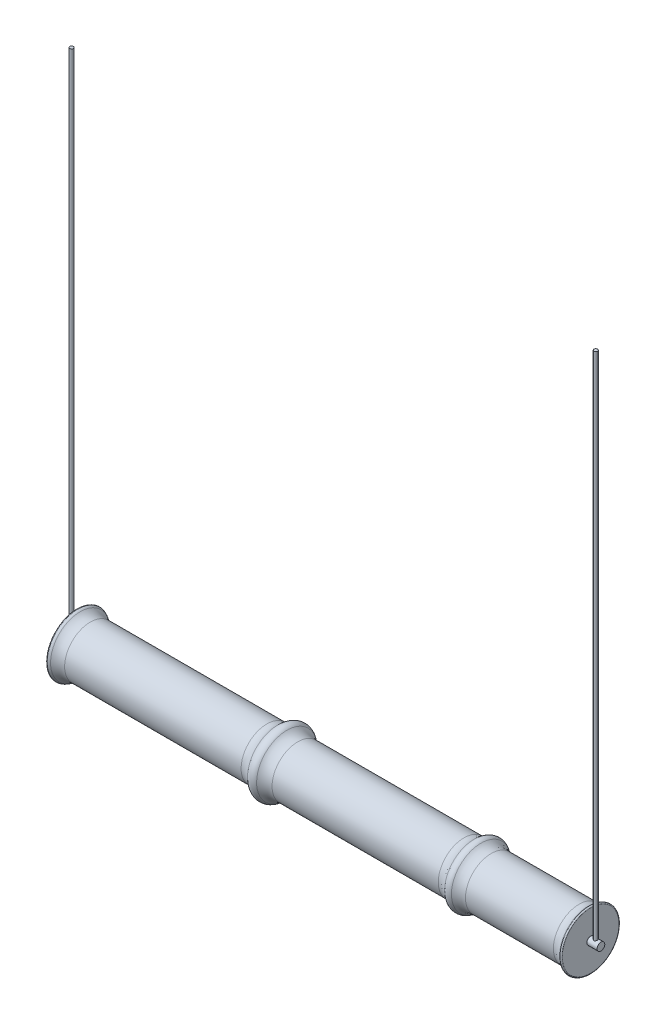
from build123d import *

# Parameters (mm, degrees)
REDONDEO1_R             = 30
REDONDEO4_R             = 2
CROQUIS3_R              = 7.5
SALIENTE_EXTRUIR1_DEPTH = 20
CROQUIS4_R              = 3.5
SALIENTE_EXTRUIR2_DEPTH = 1000


with BuildPart() as part:
    # Croquis2 → Revoluci_n1 (revolve)
    with BuildSketch(Plane.XY, mode=Mode.PRIVATE) as revoluci_n1_sk:
        with BuildLine():
            Line((-500, 0), (500, 0))
            Line((500, 0), (500, 57.5))
            ThreePointArc((500, 57.5), (494.696699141, 55.303300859), (492.5, 50))
            Line((492.5, 50), (290, 50))
            ThreePointArc((290, 50), (280, 60), (270, 50))
            Line((270, 50), (-87.5, 50))
            ThreePointArc((-87.5, 50), (-100, 62.5), (-112.5, 50))
            Line((-112.5, 50), (-490, 50))
            ThreePointArc((-490, 50), (-492.928932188, 57.071067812), (-500, 60))
            Line((-500, 60), (-500, 0))
        make_face()
    revolve(revoluci_n1_sk.sketch.rotate(Axis((-500, 0, 0), (1, 0, 0)), 180), axis=Axis((-500, 0, 0), (1, 0, 0)))

    # Redondeo1
    redondeo1_edges = [part.edges().sort_by_distance(p)[0] for p in [
        (290, 50, 0),
        (492.5, 50, 0),
        (-490, 50, 0),
        (-112.5, 50, 0),
        (-87.5, 50, 0),
        (270, 50, 0),
    ]]
    fillet(redondeo1_edges, radius=REDONDEO1_R)

    # Redondeo4
    redondeo4_edges = [part.edges().sort_by_distance(p)[0] for p in [
        (500, 57.5, 0),
        (-500, 60, 0),
    ]]
    fillet(redondeo4_edges, radius=REDONDEO4_R)


with BuildPart() as body_2:
    # Croquis3 → Saliente-Extruir1 (new body)
    with BuildSketch(Plane(origin=(500, 0, 0), x_dir=(0, 0, -1), z_dir=(1, 0, 0))):
        Circle(CROQUIS3_R)
    extrude(amount=SALIENTE_EXTRUIR1_DEPTH)

    # Croquis4 → Saliente-Extruir2 (add)
    with BuildSketch(Plane(origin=(0, 0, 0), x_dir=(1, 0, 0), z_dir=(0, 1, 0))):
        with Locations(Location((510, 0, 0), (0, 0, 90))):
            Circle(CROQUIS4_R)
    extrude(amount=SALIENTE_EXTRUIR2_DEPTH)


with BuildPart() as body_3:
    # Simetr_a1: mirrored copy
    add(body_2.part.mirror(Plane(origin=(0, 0, 0), x_dir=(0, 0, 1), z_dir=(1, 0, 0))))


solid = Compound([part.part, body_2.part, body_3.part])
